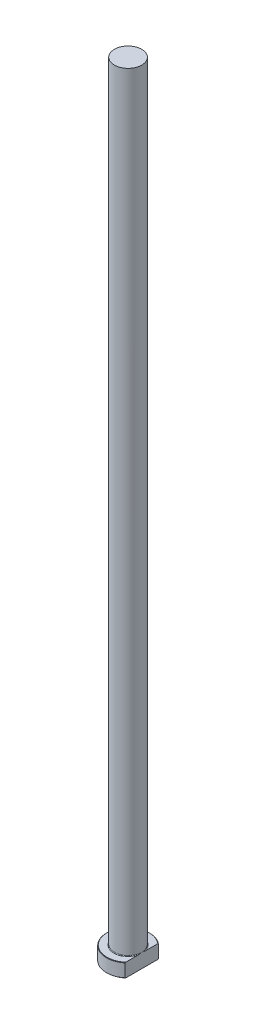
from build123d import *
from build123d.topology import SkipClean

# Parameters (mm, degrees)
CHAMFER1_SIZE = 0.2
FILLET1_R     = 0.3
KEY_DEPTH     = 401.302385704


with BuildPart() as part:
    # Sketch1 → Revolve1 (revolve)
    with BuildSketch(Plane.XY, mode=Mode.PRIVATE) as revolve1_sk:
        Polygon((0, 0), (-11, 0), (-11, 7), (-7, 7), (-7, 400), (0, 400), align=None)
    revolve(revolve1_sk.sketch.rotate(Axis((0, 259.958771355, 0), (0, -1, 0)), 270), axis=Axis((0, 259.958771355, 0), (0, -1, 0)))

    # Chamfer1
    chamfer1_edges = [part.edges().sort_by_distance(p)[0] for p in [
        (0, 7, -11),
        (0, 0, -11),
    ]]
    chamfer(chamfer1_edges, length=CHAMFER1_SIZE)

    # Fillet1
    fillet1_edges = [part.edges().sort_by_distance(p)[0] for p in [
        (0, 7, -7),
    ]]
    fillet(fillet1_edges, radius=FILLET1_R)

    # Sketch2 → KEY (cut, through all)
    with SkipClean():  # the faces are left unmerged after this step: merging them gives an invalid solid
        with BuildSketch(Plane(origin=(0, 0, 0), x_dir=(1, 0, 0), z_dir=(0, 1, 0))):
            with BuildLine():
                Line((7, 8.485281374), (7, -8.485281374))
                ThreePointArc((7, -8.485281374), (11, 0), (7, 8.485281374))
            make_face()
        extrude(amount=KEY_DEPTH, mode=Mode.SUBTRACT)


solid = part.part
